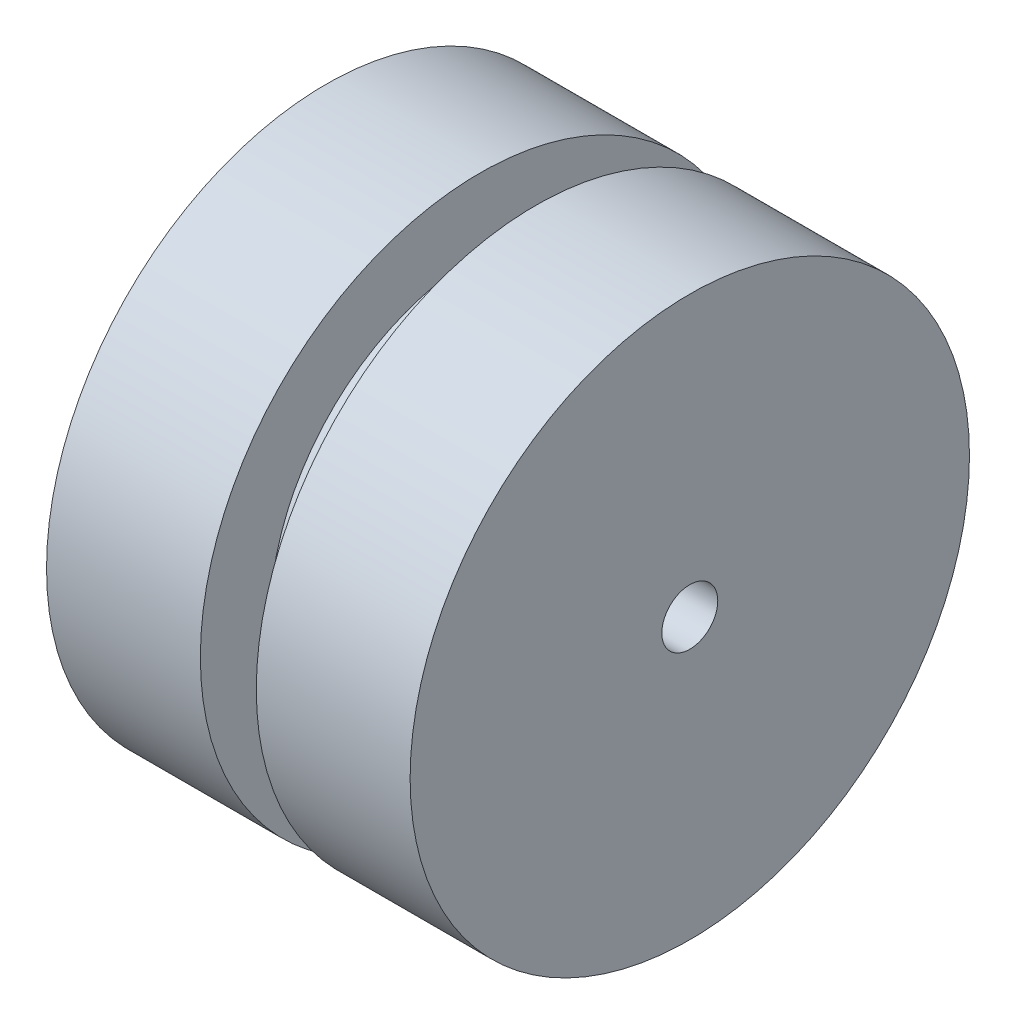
ISO-10303-21;
HEADER;
FILE_DESCRIPTION(('STEP AP214'),'2;1');
FILE_NAME('part.step','',(''),(''),'','','');
FILE_SCHEMA(('AUTOMOTIVE_DESIGN { 1 0 10303 214 1 1 1 1 }'));
ENDSEC;
DATA;
#1=APPLICATION_CONTEXT('core data for automotive mechanical design processes');
#2=APPLICATION_PROTOCOL_DEFINITION('international standard','automotive_design',2000,#1);
#3=PRODUCT_CONTEXT('',#1,'mechanical');
#4=PRODUCT('Part','Part','',(#3));
#5=PRODUCT_RELATED_PRODUCT_CATEGORY('part','',(#4));
#6=PRODUCT_DEFINITION_FORMATION('','',#4);
#7=PRODUCT_DEFINITION_CONTEXT('part definition',#1,'design');
#8=PRODUCT_DEFINITION('design','',#6,#7);
#9=PRODUCT_DEFINITION_SHAPE('','',#8);
#10=(LENGTH_UNIT() NAMED_UNIT(*) SI_UNIT(.MILLI.,.METRE.));
#11=(NAMED_UNIT(*) PLANE_ANGLE_UNIT() SI_UNIT($,.RADIAN.));
#12=(NAMED_UNIT(*) SI_UNIT($,.STERADIAN.) SOLID_ANGLE_UNIT());
#13=UNCERTAINTY_MEASURE_WITH_UNIT(LENGTH_MEASURE(1.E-05),#10,'distance_accuracy_value','');
#14=(GEOMETRIC_REPRESENTATION_CONTEXT(3) GLOBAL_UNCERTAINTY_ASSIGNED_CONTEXT((#13)) GLOBAL_UNIT_ASSIGNED_CONTEXT((#10,
#11,#12)) REPRESENTATION_CONTEXT('',''));
#15=CARTESIAN_POINT('',(0.,0.,0.));
#16=DIRECTION('',(0.,0.,1.));
#17=DIRECTION('',(1.,0.,0.));
#18=AXIS2_PLACEMENT_3D('',#15,#16,#17);
#19=CARTESIAN_POINT('',(26.,0.,0.));
#20=DIRECTION('',(-1.,0.,0.));
#21=DIRECTION('',(0.,0.,1.));
#22=AXIS2_PLACEMENT_3D('',#19,#20,#21);
#23=PLANE('',#22);
#24=CARTESIAN_POINT('',(26.,0.,0.));
#25=DIRECTION('',(1.,0.,0.));
#26=DIRECTION('',(0.,0.,-1.));
#27=AXIS2_PLACEMENT_3D('',#24,#25,#26);
#28=CIRCLE('',#27,2.);
#29=CARTESIAN_POINT('',(26.,0.,-2.));
#30=VERTEX_POINT('',#29);
#31=EDGE_CURVE('E55',#30,#30,#28,.T.);
#32=ORIENTED_EDGE('',*,*,#31,.F.);
#33=EDGE_LOOP('',(#32));
#34=FACE_BOUND('',#33,.T.);
#35=CARTESIAN_POINT('',(26.,0.,0.));
#36=DIRECTION('',(-1.,0.,0.));
#37=DIRECTION('',(0.,0.,1.));
#38=AXIS2_PLACEMENT_3D('',#35,#36,#37);
#39=CIRCLE('',#38,20.);
#40=CARTESIAN_POINT('',(26.,0.,20.));
#41=VERTEX_POINT('',#40);
#42=EDGE_CURVE('E10',#41,#41,#39,.T.);
#43=ORIENTED_EDGE('',*,*,#42,.F.);
#44=EDGE_LOOP('',(#43));
#45=FACE_BOUND('',#44,.T.);
#46=ADVANCED_FACE('F29',(#34,#45),#23,.F.);
#47=CARTESIAN_POINT('',(0.,0.,0.));
#48=DIRECTION('',(-1.,0.,0.));
#49=DIRECTION('',(0.,0.,1.));
#50=AXIS2_PLACEMENT_3D('',#47,#48,#49);
#51=CYLINDRICAL_SURFACE('',#50,20.);
#52=CARTESIAN_POINT('',(15.,0.,0.));
#53=DIRECTION('',(-1.,0.,0.));
#54=DIRECTION('',(0.,0.,1.));
#55=AXIS2_PLACEMENT_3D('',#52,#53,#54);
#56=CIRCLE('',#55,20.);
#57=CARTESIAN_POINT('',(15.,0.,20.));
#58=VERTEX_POINT('',#57);
#59=EDGE_CURVE('E35',#58,#58,#56,.T.);
#60=ORIENTED_EDGE('',*,*,#59,.F.);
#61=EDGE_LOOP('',(#60));
#62=FACE_BOUND('',#61,.T.);
#63=ORIENTED_EDGE('',*,*,#42,.T.);
#64=EDGE_LOOP('',(#63));
#65=FACE_BOUND('',#64,.T.);
#66=ADVANCED_FACE('F72',(#62,#65),#51,.T.);
#67=CARTESIAN_POINT('',(15.,20.,0.));
#68=DIRECTION('',(1.,0.,0.));
#69=DIRECTION('',(0.,0.,-1.));
#70=AXIS2_PLACEMENT_3D('',#67,#68,#69);
#71=PLANE('',#70);
#72=CARTESIAN_POINT('',(15.,0.,0.));
#73=DIRECTION('',(-1.,0.,0.));
#74=DIRECTION('',(0.,0.,1.));
#75=AXIS2_PLACEMENT_3D('',#72,#73,#74);
#76=CIRCLE('',#75,15.);
#77=CARTESIAN_POINT('',(15.,0.,15.));
#78=VERTEX_POINT('',#77);
#79=EDGE_CURVE('E39',#78,#78,#76,.T.);
#80=ORIENTED_EDGE('',*,*,#79,.F.);
#81=EDGE_LOOP('',(#80));
#82=FACE_BOUND('',#81,.T.);
#83=ORIENTED_EDGE('',*,*,#59,.T.);
#84=EDGE_LOOP('',(#83));
#85=FACE_BOUND('',#84,.T.);
#86=ADVANCED_FACE('F76',(#82,#85),#71,.F.);
#87=CARTESIAN_POINT('',(0.,0.,0.));
#88=DIRECTION('',(-1.,0.,0.));
#89=DIRECTION('',(0.,0.,1.));
#90=AXIS2_PLACEMENT_3D('',#87,#88,#89);
#91=CYLINDRICAL_SURFACE('',#90,15.);
#92=CARTESIAN_POINT('',(11.,0.,0.));
#93=DIRECTION('',(-1.,0.,0.));
#94=DIRECTION('',(0.,0.,1.));
#95=AXIS2_PLACEMENT_3D('',#92,#93,#94);
#96=CIRCLE('',#95,15.);
#97=CARTESIAN_POINT('',(11.,0.,15.));
#98=VERTEX_POINT('',#97);
#99=EDGE_CURVE('E43',#98,#98,#96,.T.);
#100=ORIENTED_EDGE('',*,*,#99,.F.);
#101=EDGE_LOOP('',(#100));
#102=FACE_BOUND('',#101,.T.);
#103=ORIENTED_EDGE('',*,*,#79,.T.);
#104=EDGE_LOOP('',(#103));
#105=FACE_BOUND('',#104,.T.);
#106=ADVANCED_FACE('F81',(#102,#105),#91,.T.);
#107=CARTESIAN_POINT('',(11.,15.,0.));
#108=DIRECTION('',(-1.,0.,0.));
#109=DIRECTION('',(0.,0.,1.));
#110=AXIS2_PLACEMENT_3D('',#107,#108,#109);
#111=PLANE('',#110);
#112=CARTESIAN_POINT('',(11.,0.,0.));
#113=DIRECTION('',(-1.,0.,0.));
#114=DIRECTION('',(0.,0.,1.));
#115=AXIS2_PLACEMENT_3D('',#112,#113,#114);
#116=CIRCLE('',#115,20.);
#117=CARTESIAN_POINT('',(11.,0.,20.));
#118=VERTEX_POINT('',#117);
#119=EDGE_CURVE('E48',#118,#118,#116,.T.);
#120=ORIENTED_EDGE('',*,*,#119,.F.);
#121=EDGE_LOOP('',(#120));
#122=FACE_BOUND('',#121,.T.);
#123=ORIENTED_EDGE('',*,*,#99,.T.);
#124=EDGE_LOOP('',(#123));
#125=FACE_BOUND('',#124,.T.);
#126=ADVANCED_FACE('F87',(#122,#125),#111,.F.);
#127=CARTESIAN_POINT('',(0.,0.,0.));
#128=DIRECTION('',(-1.,0.,0.));
#129=DIRECTION('',(0.,0.,1.));
#130=AXIS2_PLACEMENT_3D('',#127,#128,#129);
#131=CYLINDRICAL_SURFACE('',#130,20.);
#132=CARTESIAN_POINT('',(0.,0.,0.));
#133=DIRECTION('',(-1.,0.,0.));
#134=DIRECTION('',(0.,0.,1.));
#135=AXIS2_PLACEMENT_3D('',#132,#133,#134);
#136=CIRCLE('',#135,20.);
#137=CARTESIAN_POINT('',(0.,0.,20.));
#138=VERTEX_POINT('',#137);
#139=EDGE_CURVE('E51',#138,#138,#136,.T.);
#140=ORIENTED_EDGE('',*,*,#139,.F.);
#141=EDGE_LOOP('',(#140));
#142=FACE_BOUND('',#141,.T.);
#143=ORIENTED_EDGE('',*,*,#119,.T.);
#144=EDGE_LOOP('',(#143));
#145=FACE_BOUND('',#144,.T.);
#146=ADVANCED_FACE('F91',(#142,#145),#131,.T.);
#147=CARTESIAN_POINT('',(0.,20.,0.));
#148=DIRECTION('',(1.,0.,0.));
#149=DIRECTION('',(0.,0.,-1.));
#150=AXIS2_PLACEMENT_3D('',#147,#148,#149);
#151=PLANE('',#150);
#152=CARTESIAN_POINT('',(0.,0.,0.));
#153=DIRECTION('',(1.,0.,0.));
#154=DIRECTION('',(0.,0.,-1.));
#155=AXIS2_PLACEMENT_3D('',#152,#153,#154);
#156=CIRCLE('',#155,2.);
#157=CARTESIAN_POINT('',(0.,0.,-2.));
#158=VERTEX_POINT('',#157);
#159=EDGE_CURVE('E54',#158,#158,#156,.T.);
#160=ORIENTED_EDGE('',*,*,#159,.T.);
#161=EDGE_LOOP('',(#160));
#162=FACE_BOUND('',#161,.T.);
#163=ORIENTED_EDGE('',*,*,#139,.T.);
#164=EDGE_LOOP('',(#163));
#165=FACE_BOUND('',#164,.T.);
#166=ADVANCED_FACE('F61',(#162,#165),#151,.F.);
#167=CARTESIAN_POINT('',(0.,0.,0.));
#168=DIRECTION('',(1.,0.,0.));
#169=DIRECTION('',(0.,0.,-1.));
#170=AXIS2_PLACEMENT_3D('',#167,#168,#169);
#171=CYLINDRICAL_SURFACE('',#170,2.);
#172=ORIENTED_EDGE('',*,*,#159,.F.);
#173=EDGE_LOOP('',(#172));
#174=FACE_BOUND('',#173,.T.);
#175=ORIENTED_EDGE('',*,*,#31,.T.);
#176=EDGE_LOOP('',(#175));
#177=FACE_BOUND('',#176,.T.);
#178=ADVANCED_FACE('F64',(#174,#177),#171,.F.);
#179=CLOSED_SHELL('',(#46,#66,#86,#106,#126,#146,#166,#178));
#180=MANIFOLD_SOLID_BREP('B2',#179);
#181=ADVANCED_BREP_SHAPE_REPRESENTATION('',(#18,#180),#14);
#182=SHAPE_DEFINITION_REPRESENTATION(#9,#181);
ENDSEC;
END-ISO-10303-21;
